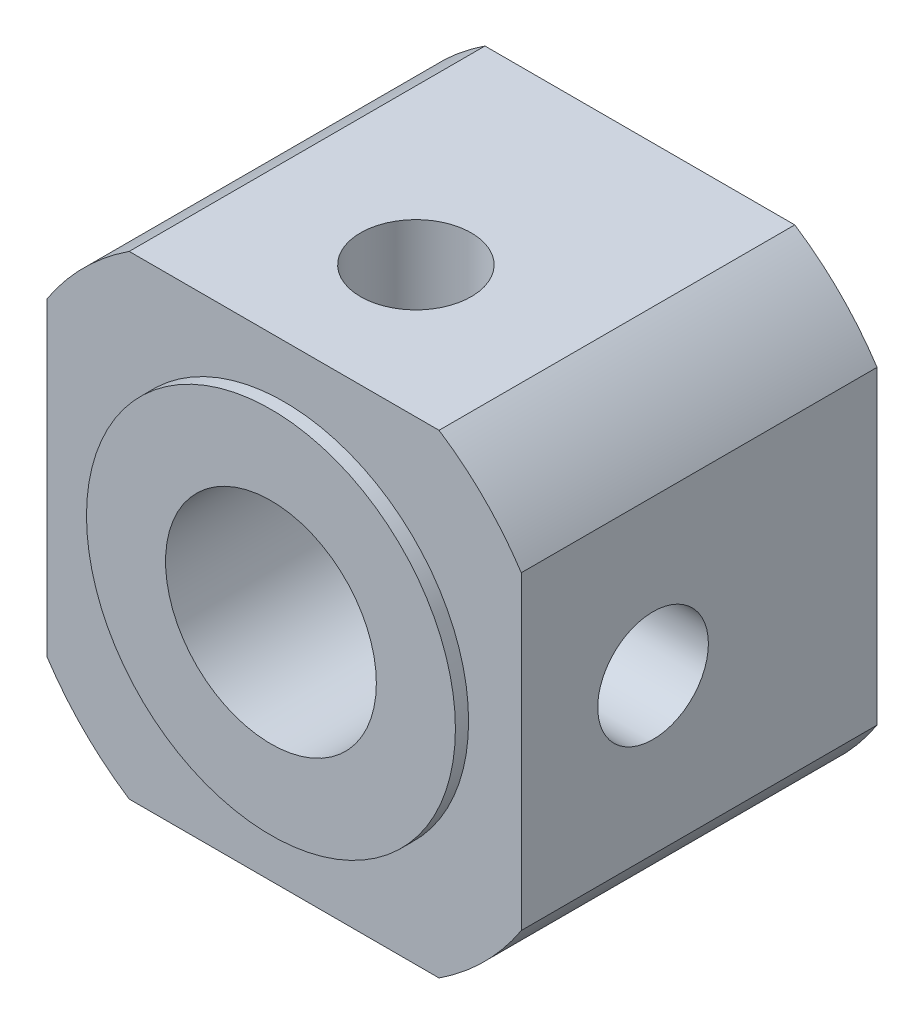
ISO-10303-21;
HEADER;
FILE_DESCRIPTION(('STEP AP214'),'2;1');
FILE_NAME('part.step','',(''),(''),'','','');
FILE_SCHEMA(('AUTOMOTIVE_DESIGN { 1 0 10303 214 1 1 1 1 }'));
ENDSEC;
DATA;
#1=APPLICATION_CONTEXT('core data for automotive mechanical design processes');
#2=APPLICATION_PROTOCOL_DEFINITION('international standard','automotive_design',2000,#1);
#3=PRODUCT_CONTEXT('',#1,'mechanical');
#4=PRODUCT('Part','Part','',(#3));
#5=PRODUCT_RELATED_PRODUCT_CATEGORY('part','',(#4));
#6=PRODUCT_DEFINITION_FORMATION('','',#4);
#7=PRODUCT_DEFINITION_CONTEXT('part definition',#1,'design');
#8=PRODUCT_DEFINITION('design','',#6,#7);
#9=PRODUCT_DEFINITION_SHAPE('','',#8);
#10=(LENGTH_UNIT() NAMED_UNIT(*) SI_UNIT(.MILLI.,.METRE.));
#11=(NAMED_UNIT(*) PLANE_ANGLE_UNIT() SI_UNIT($,.RADIAN.));
#12=(NAMED_UNIT(*) SI_UNIT($,.STERADIAN.) SOLID_ANGLE_UNIT());
#13=UNCERTAINTY_MEASURE_WITH_UNIT(LENGTH_MEASURE(1.E-05),#10,'distance_accuracy_value','');
#14=(GEOMETRIC_REPRESENTATION_CONTEXT(3) GLOBAL_UNCERTAINTY_ASSIGNED_CONTEXT((#13)) GLOBAL_UNIT_ASSIGNED_CONTEXT((#10,
#11,#12)) REPRESENTATION_CONTEXT('',''));
#15=CARTESIAN_POINT('',(0.,0.,0.));
#16=DIRECTION('',(0.,0.,1.));
#17=DIRECTION('',(1.,0.,0.));
#18=AXIS2_PLACEMENT_3D('',#15,#16,#17);
#19=CARTESIAN_POINT('',(0.,0.,5.));
#20=DIRECTION('',(0.,0.,1.));
#21=DIRECTION('',(1.,0.,0.));
#22=AXIS2_PLACEMENT_3D('',#19,#20,#21);
#23=CYLINDRICAL_SURFACE('',#22,7.);
#24=CARTESIAN_POINT('',(0.,0.,5.5));
#25=DIRECTION('',(0.,0.,1.));
#26=DIRECTION('',(1.,0.,0.));
#27=AXIS2_PLACEMENT_3D('',#24,#25,#26);
#28=CIRCLE('',#27,7.);
#29=CARTESIAN_POINT('',(7.,0.,5.5));
#30=VERTEX_POINT('',#29);
#31=EDGE_CURVE('E99',#30,#30,#28,.T.);
#32=ORIENTED_EDGE('',*,*,#31,.F.);
#33=EDGE_LOOP('',(#32));
#34=FACE_BOUND('',#33,.T.);
#35=CARTESIAN_POINT('',(0.,0.,5.));
#36=DIRECTION('',(0.,0.,1.));
#37=DIRECTION('',(1.,0.,0.));
#38=AXIS2_PLACEMENT_3D('',#35,#36,#37);
#39=CIRCLE('',#38,7.);
#40=CARTESIAN_POINT('',(7.,0.,5.));
#41=VERTEX_POINT('',#40);
#42=EDGE_CURVE('E20',#41,#41,#39,.F.);
#43=ORIENTED_EDGE('',*,*,#42,.F.);
#44=EDGE_LOOP('',(#43));
#45=FACE_BOUND('',#44,.T.);
#46=ADVANCED_FACE('F16',(#34,#45),#23,.T.);
#47=CARTESIAN_POINT('',(0.,0.,5.));
#48=DIRECTION('',(0.,0.,1.));
#49=DIRECTION('',(1.,0.,0.));
#50=AXIS2_PLACEMENT_3D('',#47,#48,#49);
#51=PLANE('',#50);
#52=ORIENTED_EDGE('',*,*,#42,.T.);
#53=EDGE_LOOP('',(#52));
#54=FACE_BOUND('',#53,.T.);
#55=CARTESIAN_POINT('',(0.,0.,5.));
#56=DIRECTION('',(0.,0.,1.));
#57=DIRECTION('',(1.,0.,0.));
#58=AXIS2_PLACEMENT_3D('',#55,#56,#57);
#59=CIRCLE('',#58,10.75);
#60=CARTESIAN_POINT('',(5.87898800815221,9.,5.));
#61=VERTEX_POINT('',#60);
#62=CARTESIAN_POINT('',(9.,5.87898800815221,5.));
#63=VERTEX_POINT('',#62);
#64=EDGE_CURVE('E89',#61,#63,#59,.F.);
#65=ORIENTED_EDGE('',*,*,#64,.F.);
#66=DIRECTION('',(1.,0.,0.));
#67=VECTOR('',#66,1.);
#68=CARTESIAN_POINT('',(5.878988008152,9.,5.));
#69=LINE('',#68,#67);
#70=CARTESIAN_POINT('',(-5.87898800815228,9.0000000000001,5.));
#71=VERTEX_POINT('',#70);
#72=EDGE_CURVE('E79',#71,#61,#69,.T.);
#73=ORIENTED_EDGE('',*,*,#72,.F.);
#74=CARTESIAN_POINT('',(0.,0.,5.));
#75=DIRECTION('',(0.,0.,1.));
#76=DIRECTION('',(1.,0.,0.));
#77=AXIS2_PLACEMENT_3D('',#74,#75,#76);
#78=CIRCLE('',#77,10.75);
#79=CARTESIAN_POINT('',(-9.,5.87898800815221,5.));
#80=VERTEX_POINT('',#79);
#81=EDGE_CURVE('E107',#80,#71,#78,.F.);
#82=ORIENTED_EDGE('',*,*,#81,.F.);
#83=DIRECTION('',(0.,1.,0.));
#84=VECTOR('',#83,1.);
#85=CARTESIAN_POINT('',(-9.,5.878988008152,5.));
#86=LINE('',#85,#84);
#87=CARTESIAN_POINT('',(-9.0000000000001,-5.87898800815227,5.));
#88=VERTEX_POINT('',#87);
#89=EDGE_CURVE('E118',#88,#80,#86,.T.);
#90=ORIENTED_EDGE('',*,*,#89,.F.);
#91=CARTESIAN_POINT('',(0.,0.,5.));
#92=DIRECTION('',(0.,0.,1.));
#93=DIRECTION('',(1.,0.,0.));
#94=AXIS2_PLACEMENT_3D('',#91,#92,#93);
#95=CIRCLE('',#94,10.75);
#96=CARTESIAN_POINT('',(-5.87898800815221,-9.,5.));
#97=VERTEX_POINT('',#96);
#98=EDGE_CURVE('E212',#97,#88,#95,.F.);
#99=ORIENTED_EDGE('',*,*,#98,.F.);
#100=DIRECTION('',(1.,0.,0.));
#101=VECTOR('',#100,1.);
#102=CARTESIAN_POINT('',(-5.878988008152,-9.,5.));
#103=LINE('',#102,#101);
#104=CARTESIAN_POINT('',(5.87898800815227,-9.0000000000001,5.));
#105=VERTEX_POINT('',#104);
#106=EDGE_CURVE('E114',#105,#97,#103,.F.);
#107=ORIENTED_EDGE('',*,*,#106,.F.);
#108=CARTESIAN_POINT('',(0.,0.,5.));
#109=DIRECTION('',(0.,0.,1.));
#110=DIRECTION('',(1.,0.,0.));
#111=AXIS2_PLACEMENT_3D('',#108,#109,#110);
#112=CIRCLE('',#111,10.75);
#113=CARTESIAN_POINT('',(9.,-5.87898800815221,5.));
#114=VERTEX_POINT('',#113);
#115=EDGE_CURVE('E210',#114,#105,#112,.F.);
#116=ORIENTED_EDGE('',*,*,#115,.F.);
#117=DIRECTION('',(0.,1.,0.));
#118=VECTOR('',#117,1.);
#119=CARTESIAN_POINT('',(9.,-5.878988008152,5.));
#120=LINE('',#119,#118);
#121=EDGE_CURVE('E95',#63,#114,#120,.F.);
#122=ORIENTED_EDGE('',*,*,#121,.F.);
#123=EDGE_LOOP('',(#65,#73,#82,#90,#99,#107,#116,#122));
#124=FACE_BOUND('',#123,.T.);
#125=ADVANCED_FACE('F93',(#54,#124),#51,.T.);
#126=CARTESIAN_POINT('',(0.,0.,5.5));
#127=DIRECTION('',(0.,0.,1.));
#128=DIRECTION('',(1.,0.,0.));
#129=AXIS2_PLACEMENT_3D('',#126,#127,#128);
#130=PLANE('',#129);
#131=CARTESIAN_POINT('',(0.,0.,5.5));
#132=DIRECTION('',(0.,0.,1.));
#133=DIRECTION('',(1.,0.,0.));
#134=AXIS2_PLACEMENT_3D('',#131,#132,#133);
#135=CIRCLE('',#134,4.);
#136=CARTESIAN_POINT('',(4.,0.,5.5));
#137=VERTEX_POINT('',#136);
#138=EDGE_CURVE('E250',#137,#137,#135,.F.);
#139=ORIENTED_EDGE('',*,*,#138,.T.);
#140=EDGE_LOOP('',(#139));
#141=FACE_BOUND('',#140,.T.);
#142=ORIENTED_EDGE('',*,*,#31,.T.);
#143=EDGE_LOOP('',(#142));
#144=FACE_BOUND('',#143,.T.);
#145=ADVANCED_FACE('F234',(#141,#144),#130,.T.);
#146=CARTESIAN_POINT('',(0.,0.,0.));
#147=DIRECTION('',(1.,0.,0.));
#148=DIRECTION('',(0.,0.,-1.));
#149=AXIS2_PLACEMENT_3D('',#146,#147,#148);
#150=CYLINDRICAL_SURFACE('',#149,2.1);
#151=CARTESIAN_POINT('',(9.,0.,0.));
#152=DIRECTION('',(1.,0.,0.));
#153=DIRECTION('',(0.,0.,-1.));
#154=AXIS2_PLACEMENT_3D('',#151,#152,#153);
#155=CIRCLE('',#154,2.1);
#156=CARTESIAN_POINT('',(9.,0.,-2.1));
#157=VERTEX_POINT('',#156);
#158=EDGE_CURVE('E207',#157,#157,#155,.F.);
#159=ORIENTED_EDGE('',*,*,#158,.F.);
#160=EDGE_LOOP('',(#159));
#161=FACE_BOUND('',#160,.T.);
#162=CARTESIAN_POINT('',(4.,0.,2.1));
#163=CARTESIAN_POINT('',(3.99999554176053,0.109803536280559,2.09999503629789));
#164=CARTESIAN_POINT('',(3.99543467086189,0.219658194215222,2.09134364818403));
#165=CARTESIAN_POINT('',(3.97764995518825,0.436025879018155,2.05715950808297));
#166=CARTESIAN_POINT('',(3.96441836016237,0.542535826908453,2.03161165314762));
#167=CARTESIAN_POINT('',(3.93066508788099,0.748842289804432,1.96492968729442));
#168=CARTESIAN_POINT('',(3.91017049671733,0.848662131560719,1.92385344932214));
#169=CARTESIAN_POINT('',(3.86373215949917,1.03983925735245,1.82762126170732));
#170=CARTESIAN_POINT('',(3.83778764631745,1.13119534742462,1.77246332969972));
#171=CARTESIAN_POINT('',(3.7808192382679,1.30947331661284,1.64560391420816));
#172=CARTESIAN_POINT('',(3.74957540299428,1.3957267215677,1.57306344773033));
#173=CARTESIAN_POINT('',(3.68617980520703,1.55546702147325,1.41532332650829));
#174=CARTESIAN_POINT('',(3.65402732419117,1.62894346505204,1.33011341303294));
#175=CARTESIAN_POINT('',(3.58917605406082,1.76753206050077,1.14052425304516));
#176=CARTESIAN_POINT('',(3.55667656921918,1.83134586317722,1.03511929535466));
#177=CARTESIAN_POINT('',(3.49855996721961,1.94007792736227,0.813221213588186));
#178=CARTESIAN_POINT('',(3.47293763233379,1.98501052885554,0.69673658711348));
#179=CARTESIAN_POINT('',(3.43398314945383,2.0516277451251,0.463269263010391));
#180=CARTESIAN_POINT('',(3.41998737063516,2.07458126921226,0.346765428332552));
#181=CARTESIAN_POINT('',(3.40418722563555,2.10042064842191,0.110792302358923));
#182=CARTESIAN_POINT('',(3.40236842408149,2.10333026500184,-0.0086733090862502));
#183=CARTESIAN_POINT('',(3.41060563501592,2.08992575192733,-0.229764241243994));
#184=CARTESIAN_POINT('',(3.41908941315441,2.0761574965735,-0.331617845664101));
#185=CARTESIAN_POINT('',(3.44418919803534,2.0342447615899,-0.531280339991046));
#186=CARTESIAN_POINT('',(3.46080826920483,2.00609486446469,-0.629087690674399));
#187=CARTESIAN_POINT('',(3.50064034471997,1.935761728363,-0.820661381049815));
#188=CARTESIAN_POINT('',(3.52399503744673,1.89327319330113,-0.914284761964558));
#189=CARTESIAN_POINT('',(3.57469224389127,1.79571567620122,-1.09354021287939));
#190=CARTESIAN_POINT('',(3.60203646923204,1.7406412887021,-1.17916882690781));
#191=CARTESIAN_POINT('',(3.66230185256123,1.61039980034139,-1.35277293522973));
#192=CARTESIAN_POINT('',(3.69546437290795,1.53349171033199,-1.43936319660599));
#193=CARTESIAN_POINT('',(3.76053411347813,1.36617837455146,-1.59904319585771));
#194=CARTESIAN_POINT('',(3.79244039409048,1.27576325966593,-1.67212297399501));
#195=CARTESIAN_POINT('',(3.85357924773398,1.07762049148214,-1.80661637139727));
#196=CARTESIAN_POINT('',(3.88255897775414,0.969203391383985,-1.86713779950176));
#197=CARTESIAN_POINT('',(3.93230876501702,0.741890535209,-1.96850527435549));
#198=CARTESIAN_POINT('',(3.95309407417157,0.623014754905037,-2.00938790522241));
#199=CARTESIAN_POINT('',(3.97880627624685,0.419385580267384,-2.05941202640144));
#200=CARTESIAN_POINT('',(3.98670889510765,0.336445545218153,-2.07458929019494));
#201=CARTESIAN_POINT('',(3.99730707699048,0.169013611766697,-2.09488442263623));
#202=CARTESIAN_POINT('',(4.00000343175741,0.0845219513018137,-2.10000382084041));
#203=CARTESIAN_POINT('',(3.99999554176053,-0.109803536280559,-2.09999503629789));
#204=CARTESIAN_POINT('',(3.99543467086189,-0.219658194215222,-2.09134364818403));
#205=CARTESIAN_POINT('',(3.97764995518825,-0.436025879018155,-2.05715950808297));
#206=CARTESIAN_POINT('',(3.96441836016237,-0.542535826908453,-2.03161165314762));
#207=CARTESIAN_POINT('',(3.93066508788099,-0.748842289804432,-1.96492968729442));
#208=CARTESIAN_POINT('',(3.91017049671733,-0.848662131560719,-1.92385344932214));
#209=CARTESIAN_POINT('',(3.86373215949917,-1.03983925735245,-1.82762126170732));
#210=CARTESIAN_POINT('',(3.83778764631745,-1.13119534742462,-1.77246332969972));
#211=CARTESIAN_POINT('',(3.7808192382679,-1.30947331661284,-1.64560391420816));
#212=CARTESIAN_POINT('',(3.74957540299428,-1.3957267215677,-1.57306344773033));
#213=CARTESIAN_POINT('',(3.68617980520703,-1.55546702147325,-1.41532332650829));
#214=CARTESIAN_POINT('',(3.65402732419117,-1.62894346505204,-1.33011341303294));
#215=CARTESIAN_POINT('',(3.58917605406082,-1.76753206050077,-1.14052425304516));
#216=CARTESIAN_POINT('',(3.55667656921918,-1.83134586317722,-1.03511929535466));
#217=CARTESIAN_POINT('',(3.49855996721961,-1.94007792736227,-0.813221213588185));
#218=CARTESIAN_POINT('',(3.47293763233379,-1.98501052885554,-0.696736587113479));
#219=CARTESIAN_POINT('',(3.43398314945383,-2.0516277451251,-0.463269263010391));
#220=CARTESIAN_POINT('',(3.41998737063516,-2.07458126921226,-0.346765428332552));
#221=CARTESIAN_POINT('',(3.40418722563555,-2.10042064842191,-0.110792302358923));
#222=CARTESIAN_POINT('',(3.40236842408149,-2.10333026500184,0.00867330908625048));
#223=CARTESIAN_POINT('',(3.41060563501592,-2.08992575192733,0.229764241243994));
#224=CARTESIAN_POINT('',(3.41908941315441,-2.0761574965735,0.331617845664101));
#225=CARTESIAN_POINT('',(3.44418919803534,-2.0342447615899,0.531280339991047));
#226=CARTESIAN_POINT('',(3.46080826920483,-2.00609486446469,0.6290876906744));
#227=CARTESIAN_POINT('',(3.50064034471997,-1.935761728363,0.820661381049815));
#228=CARTESIAN_POINT('',(3.52399503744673,-1.89327319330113,0.914284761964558));
#229=CARTESIAN_POINT('',(3.57469224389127,-1.79571567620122,1.09354021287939));
#230=CARTESIAN_POINT('',(3.60203646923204,-1.7406412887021,1.17916882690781));
#231=CARTESIAN_POINT('',(3.66230185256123,-1.61039980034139,1.35277293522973));
#232=CARTESIAN_POINT('',(3.69546437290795,-1.53349171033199,1.43936319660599));
#233=CARTESIAN_POINT('',(3.76053411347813,-1.36617837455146,1.59904319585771));
#234=CARTESIAN_POINT('',(3.79244039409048,-1.27576325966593,1.67212297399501));
#235=CARTESIAN_POINT('',(3.85357924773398,-1.07762049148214,1.80661637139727));
#236=CARTESIAN_POINT('',(3.88255897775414,-0.969203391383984,1.86713779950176));
#237=CARTESIAN_POINT('',(3.93230876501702,-0.741890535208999,1.96850527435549));
#238=CARTESIAN_POINT('',(3.95309407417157,-0.623014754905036,2.00938790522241));
#239=CARTESIAN_POINT('',(3.97880627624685,-0.419385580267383,2.05941202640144));
#240=CARTESIAN_POINT('',(3.98670889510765,-0.336445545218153,2.07458929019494));
#241=CARTESIAN_POINT('',(3.99730707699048,-0.169013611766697,2.09488442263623));
#242=CARTESIAN_POINT('',(4.00000343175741,-0.0845219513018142,2.10000382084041));
#243=CARTESIAN_POINT('',(4.,0.,2.1));
#244=B_SPLINE_CURVE_WITH_KNOTS('',3,(#162,#163,#164,#165,#166,#167,#168,#169,#170,#171,#172,
#173,#174,#175,#176,#177,#178,#179,#180,#181,#182,#183,#184,#185,#186,#187,#188,#189,#190,#191,
#192,#193,#194,#195,#196,#197,#198,#199,#200,#201,#202,#203,#204,#205,#206,#207,#208,#209,#210,
#211,#212,#213,#214,#215,#216,#217,#218,#219,#220,#221,#222,#223,#224,#225,#226,#227,#228,#229,
#230,#231,#232,#233,#234,#235,#236,#237,#238,#239,#240,#241,#242,#243),.UNSPECIFIED.,.T.,.F.,(4,
2,2,2,2,2,2,2,2,2,2,2,2,2,2,2,2,2,2,2,2,2,2,2,2,2,2,2,2,2,2,2,2,2,2,2,2,2,2,2,4),(0.,
0.329077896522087,0.658450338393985,0.986607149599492,1.31481018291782,1.66423090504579,
2.01393611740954,2.39430508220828,2.77438463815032,3.13089377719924,3.48698021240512,
3.79492359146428,4.1029830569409,4.41806553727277,4.7332835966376,5.09314587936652,
5.45327239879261,5.83374180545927,6.21349967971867,6.46684795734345,6.72015770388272,
7.0492356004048,7.3786080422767,7.70676485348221,8.03496788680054,8.3843886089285,
8.73409382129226,9.11446278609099,9.49454234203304,9.85105148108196,10.2071379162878,
10.515081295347,10.8231407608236,11.1382232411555,11.4534413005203,11.8133035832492,
12.1734301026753,12.553899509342,12.9336573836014,13.1870056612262,13.4403154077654),.UNSPECIFIED.);
#245=CARTESIAN_POINT('',(4.,0.,2.1));
#246=VERTEX_POINT('',#245);
#247=EDGE_CURVE('E140',#246,#246,#244,.T.);
#248=ORIENTED_EDGE('',*,*,#247,.T.);
#249=EDGE_LOOP('',(#248));
#250=FACE_BOUND('',#249,.T.);
#251=ADVANCED_FACE('F185',(#161,#250),#150,.F.);
#252=CARTESIAN_POINT('',(0.,0.,0.));
#253=DIRECTION('',(0.,1.,0.));
#254=DIRECTION('',(0.,0.,1.));
#255=AXIS2_PLACEMENT_3D('',#252,#253,#254);
#256=CYLINDRICAL_SURFACE('',#255,2.1);
#257=CARTESIAN_POINT('',(0.,9.,0.));
#258=DIRECTION('',(0.,1.,0.));
#259=DIRECTION('',(0.,0.,1.));
#260=AXIS2_PLACEMENT_3D('',#257,#258,#259);
#261=CIRCLE('',#260,2.1);
#262=CARTESIAN_POINT('',(0.,9.,2.1));
#263=VERTEX_POINT('',#262);
#264=EDGE_CURVE('E104',#263,#263,#261,.F.);
#265=ORIENTED_EDGE('',*,*,#264,.F.);
#266=EDGE_LOOP('',(#265));
#267=FACE_BOUND('',#266,.T.);
#268=CARTESIAN_POINT('',(0.,4.,-2.1));
#269=CARTESIAN_POINT('',(0.109803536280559,3.99999554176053,-2.09999503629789));
#270=CARTESIAN_POINT('',(0.219658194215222,3.99543467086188,-2.09134364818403));
#271=CARTESIAN_POINT('',(0.436025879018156,3.97764995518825,-2.05715950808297));
#272=CARTESIAN_POINT('',(0.542535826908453,3.96441836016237,-2.03161165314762));
#273=CARTESIAN_POINT('',(0.748842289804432,3.93066508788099,-1.96492968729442));
#274=CARTESIAN_POINT('',(0.84866213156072,3.91017049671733,-1.92385344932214));
#275=CARTESIAN_POINT('',(1.03983925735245,3.86373215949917,-1.82762126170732));
#276=CARTESIAN_POINT('',(1.13119534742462,3.83778764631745,-1.77246332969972));
#277=CARTESIAN_POINT('',(1.30947331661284,3.7808192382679,-1.64560391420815));
#278=CARTESIAN_POINT('',(1.3957267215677,3.74957540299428,-1.57306344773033));
#279=CARTESIAN_POINT('',(1.55546702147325,3.68617980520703,-1.41532332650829));
#280=CARTESIAN_POINT('',(1.62894346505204,3.65402732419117,-1.33011341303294));
#281=CARTESIAN_POINT('',(1.76753206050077,3.58917605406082,-1.14052425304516));
#282=CARTESIAN_POINT('',(1.83134586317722,3.55667656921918,-1.03511929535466));
#283=CARTESIAN_POINT('',(1.94007792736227,3.49855996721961,-0.813221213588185));
#284=CARTESIAN_POINT('',(1.98501052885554,3.47293763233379,-0.696736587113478));
#285=CARTESIAN_POINT('',(2.0516277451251,3.43398314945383,-0.46326926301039));
#286=CARTESIAN_POINT('',(2.07458126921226,3.41998737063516,-0.346765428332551));
#287=CARTESIAN_POINT('',(2.10042064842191,3.40418722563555,-0.110792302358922));
#288=CARTESIAN_POINT('',(2.10333026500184,3.40236842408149,0.00867330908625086));
#289=CARTESIAN_POINT('',(2.08992575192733,3.41060563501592,0.229764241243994));
#290=CARTESIAN_POINT('',(2.0761574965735,3.41908941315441,0.331617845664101));
#291=CARTESIAN_POINT('',(2.0342447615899,3.44418919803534,0.531280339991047));
#292=CARTESIAN_POINT('',(2.00609486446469,3.46080826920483,0.6290876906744));
#293=CARTESIAN_POINT('',(1.935761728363,3.50064034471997,0.820661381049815));
#294=CARTESIAN_POINT('',(1.89327319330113,3.52399503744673,0.914284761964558));
#295=CARTESIAN_POINT('',(1.79571567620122,3.57469224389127,1.09354021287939));
#296=CARTESIAN_POINT('',(1.7406412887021,3.60203646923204,1.17916882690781));
#297=CARTESIAN_POINT('',(1.61039980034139,3.66230185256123,1.35277293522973));
#298=CARTESIAN_POINT('',(1.53349171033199,3.69546437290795,1.43936319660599));
#299=CARTESIAN_POINT('',(1.36617837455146,3.76053411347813,1.59904319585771));
#300=CARTESIAN_POINT('',(1.27576325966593,3.79244039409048,1.67212297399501));
#301=CARTESIAN_POINT('',(1.07762049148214,3.85357924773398,1.80661637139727));
#302=CARTESIAN_POINT('',(0.969203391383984,3.88255897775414,1.86713779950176));
#303=CARTESIAN_POINT('',(0.741890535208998,3.93230876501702,1.96850527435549));
#304=CARTESIAN_POINT('',(0.623014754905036,3.95309407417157,2.00938790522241));
#305=CARTESIAN_POINT('',(0.419385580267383,3.97880627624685,2.05941202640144));
#306=CARTESIAN_POINT('',(0.336445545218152,3.98670889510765,2.07458929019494));
#307=CARTESIAN_POINT('',(0.169013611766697,3.99730707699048,2.09488442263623));
#308=CARTESIAN_POINT('',(0.0845219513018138,4.00000343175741,2.10000382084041));
#309=CARTESIAN_POINT('',(-0.109803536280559,3.99999554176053,2.09999503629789));
#310=CARTESIAN_POINT('',(-0.219658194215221,3.99543467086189,2.09134364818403));
#311=CARTESIAN_POINT('',(-0.436025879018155,3.97764995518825,2.05715950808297));
#312=CARTESIAN_POINT('',(-0.542535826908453,3.96441836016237,2.03161165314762));
#313=CARTESIAN_POINT('',(-0.748842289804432,3.93066508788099,1.96492968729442));
#314=CARTESIAN_POINT('',(-0.848662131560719,3.91017049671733,1.92385344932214));
#315=CARTESIAN_POINT('',(-1.03983925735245,3.86373215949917,1.82762126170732));
#316=CARTESIAN_POINT('',(-1.13119534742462,3.83778764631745,1.77246332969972));
#317=CARTESIAN_POINT('',(-1.30947331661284,3.7808192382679,1.64560391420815));
#318=CARTESIAN_POINT('',(-1.3957267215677,3.74957540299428,1.57306344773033));
#319=CARTESIAN_POINT('',(-1.55546702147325,3.68617980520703,1.41532332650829));
#320=CARTESIAN_POINT('',(-1.62894346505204,3.65402732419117,1.33011341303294));
#321=CARTESIAN_POINT('',(-1.76753206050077,3.58917605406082,1.14052425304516));
#322=CARTESIAN_POINT('',(-1.83134586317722,3.55667656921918,1.03511929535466));
#323=CARTESIAN_POINT('',(-1.94007792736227,3.49855996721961,0.813221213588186));
#324=CARTESIAN_POINT('',(-1.98501052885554,3.47293763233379,0.696736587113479));
#325=CARTESIAN_POINT('',(-2.0516277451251,3.43398314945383,0.46326926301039));
#326=CARTESIAN_POINT('',(-2.07458126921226,3.41998737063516,0.346765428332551));
#327=CARTESIAN_POINT('',(-2.10042064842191,3.40418722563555,0.110792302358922));
#328=CARTESIAN_POINT('',(-2.10333026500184,3.40236842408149,-0.00867330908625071));
#329=CARTESIAN_POINT('',(-2.08992575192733,3.41060563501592,-0.229764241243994));
#330=CARTESIAN_POINT('',(-2.0761574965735,3.41908941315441,-0.331617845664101));
#331=CARTESIAN_POINT('',(-2.0342447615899,3.44418919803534,-0.531280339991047));
#332=CARTESIAN_POINT('',(-2.00609486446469,3.46080826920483,-0.6290876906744));
#333=CARTESIAN_POINT('',(-1.935761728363,3.50064034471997,-0.820661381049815));
#334=CARTESIAN_POINT('',(-1.89327319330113,3.52399503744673,-0.914284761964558));
#335=CARTESIAN_POINT('',(-1.79571567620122,3.57469224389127,-1.09354021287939));
#336=CARTESIAN_POINT('',(-1.7406412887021,3.60203646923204,-1.17916882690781));
#337=CARTESIAN_POINT('',(-1.61039980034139,3.66230185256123,-1.35277293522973));
#338=CARTESIAN_POINT('',(-1.53349171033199,3.69546437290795,-1.43936319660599));
#339=CARTESIAN_POINT('',(-1.36617837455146,3.76053411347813,-1.59904319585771));
#340=CARTESIAN_POINT('',(-1.27576325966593,3.79244039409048,-1.67212297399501));
#341=CARTESIAN_POINT('',(-1.07762049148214,3.85357924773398,-1.80661637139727));
#342=CARTESIAN_POINT('',(-0.969203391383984,3.88255897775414,-1.86713779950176));
#343=CARTESIAN_POINT('',(-0.741890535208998,3.93230876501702,-1.96850527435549));
#344=CARTESIAN_POINT('',(-0.623014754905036,3.95309407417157,-2.00938790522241));
#345=CARTESIAN_POINT('',(-0.419385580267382,3.97880627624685,-2.05941202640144));
#346=CARTESIAN_POINT('',(-0.336445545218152,3.98670889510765,-2.07458929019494));
#347=CARTESIAN_POINT('',(-0.169013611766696,3.99730707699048,-2.09488442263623));
#348=CARTESIAN_POINT('',(-0.0845219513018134,4.00000343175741,-2.10000382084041));
#349=CARTESIAN_POINT('',(0.,4.,-2.1));
#350=B_SPLINE_CURVE_WITH_KNOTS('',3,(#268,#269,#270,#271,#272,#273,#274,#275,#276,#277,#278,
#279,#280,#281,#282,#283,#284,#285,#286,#287,#288,#289,#290,#291,#292,#293,#294,#295,#296,#297,
#298,#299,#300,#301,#302,#303,#304,#305,#306,#307,#308,#309,#310,#311,#312,#313,#314,#315,#316,
#317,#318,#319,#320,#321,#322,#323,#324,#325,#326,#327,#328,#329,#330,#331,#332,#333,#334,#335,
#336,#337,#338,#339,#340,#341,#342,#343,#344,#345,#346,#347,#348,#349),.UNSPECIFIED.,.T.,.F.,(4,
2,2,2,2,2,2,2,2,2,2,2,2,2,2,2,2,2,2,2,2,2,2,2,2,2,2,2,2,2,2,2,2,2,2,2,2,2,2,2,4),(0.,
0.329077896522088,0.658450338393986,0.986607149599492,1.31481018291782,1.66423090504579,
2.01393611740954,2.39430508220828,2.77438463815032,3.13089377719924,3.48698021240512,
3.79492359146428,4.1029830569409,4.41806553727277,4.7332835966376,5.09314587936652,
5.45327239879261,5.83374180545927,6.21349967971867,6.46684795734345,6.72015770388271,
7.0492356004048,7.3786080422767,7.70676485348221,8.03496788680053,8.3843886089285,
8.73409382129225,9.11446278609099,9.49454234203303,9.85105148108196,10.2071379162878,
10.515081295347,10.8231407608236,11.1382232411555,11.4534413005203,11.8133035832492,
12.1734301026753,12.553899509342,12.9336573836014,13.1870056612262,13.4403154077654),.UNSPECIFIED.);
#351=CARTESIAN_POINT('',(0.,4.,-2.1));
#352=VERTEX_POINT('',#351);
#353=EDGE_CURVE('E134',#352,#352,#350,.T.);
#354=ORIENTED_EDGE('',*,*,#353,.T.);
#355=EDGE_LOOP('',(#354));
#356=FACE_BOUND('',#355,.T.);
#357=ADVANCED_FACE('F145',(#267,#356),#256,.F.);
#358=CARTESIAN_POINT('',(0.,0.,-8.5));
#359=DIRECTION('',(0.,0.,1.));
#360=DIRECTION('',(1.,0.,0.));
#361=AXIS2_PLACEMENT_3D('',#358,#359,#360);
#362=CYLINDRICAL_SURFACE('',#361,10.75);
#363=ORIENTED_EDGE('',*,*,#64,.T.);
#364=DIRECTION('',(0.,0.,-1.));
#365=VECTOR('',#364,1.);
#366=CARTESIAN_POINT('',(9.,5.878988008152,-8.5));
#367=LINE('',#366,#365);
#368=CARTESIAN_POINT('',(9.,5.87898800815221,-8.5));
#369=VERTEX_POINT('',#368);
#370=EDGE_CURVE('E113',#369,#63,#367,.F.);
#371=ORIENTED_EDGE('',*,*,#370,.F.);
#372=CARTESIAN_POINT('',(0.,0.,-8.5));
#373=DIRECTION('',(0.,0.,1.));
#374=DIRECTION('',(1.,0.,0.));
#375=AXIS2_PLACEMENT_3D('',#372,#373,#374);
#376=CIRCLE('',#375,10.75);
#377=CARTESIAN_POINT('',(5.87898800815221,9.,-8.5));
#378=VERTEX_POINT('',#377);
#379=EDGE_CURVE('E103',#369,#378,#376,.T.);
#380=ORIENTED_EDGE('',*,*,#379,.T.);
#381=DIRECTION('',(0.,0.,1.));
#382=VECTOR('',#381,1.);
#383=CARTESIAN_POINT('',(5.878988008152,9.,-8.5));
#384=LINE('',#383,#382);
#385=EDGE_CURVE('E84',#61,#378,#384,.F.);
#386=ORIENTED_EDGE('',*,*,#385,.F.);
#387=EDGE_LOOP('',(#363,#371,#380,#386));
#388=FACE_BOUND('',#387,.T.);
#389=ADVANCED_FACE('F102',(#388),#362,.T.);
#390=CARTESIAN_POINT('',(5.878988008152,9.,-8.5));
#391=DIRECTION('',(0.,1.,0.));
#392=DIRECTION('',(0.,0.,1.));
#393=AXIS2_PLACEMENT_3D('',#390,#391,#392);
#394=PLANE('',#393);
#395=ORIENTED_EDGE('',*,*,#264,.T.);
#396=EDGE_LOOP('',(#395));
#397=FACE_BOUND('',#396,.T.);
#398=ORIENTED_EDGE('',*,*,#72,.T.);
#399=ORIENTED_EDGE('',*,*,#385,.T.);
#400=DIRECTION('',(1.,0.,0.));
#401=VECTOR('',#400,1.);
#402=CARTESIAN_POINT('',(0.,9.,-8.5));
#403=LINE('',#402,#401);
#404=CARTESIAN_POINT('',(-5.87898800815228,9.0000000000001,-8.5));
#405=VERTEX_POINT('',#404);
#406=EDGE_CURVE('E132',#378,#405,#403,.F.);
#407=ORIENTED_EDGE('',*,*,#406,.T.);
#408=DIRECTION('',(0.,0.,1.));
#409=VECTOR('',#408,1.);
#410=CARTESIAN_POINT('',(-5.87898800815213,9.00000000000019,-8.5));
#411=LINE('',#410,#409);
#412=EDGE_CURVE('E86',#71,#405,#411,.F.);
#413=ORIENTED_EDGE('',*,*,#412,.F.);
#414=EDGE_LOOP('',(#398,#399,#407,#413));
#415=FACE_BOUND('',#414,.T.);
#416=ADVANCED_FACE('F81',(#397,#415),#394,.T.);
#417=CARTESIAN_POINT('',(0.,0.,-8.5));
#418=DIRECTION('',(0.,0.,1.));
#419=DIRECTION('',(1.,0.,0.));
#420=AXIS2_PLACEMENT_3D('',#417,#418,#419);
#421=CYLINDRICAL_SURFACE('',#420,10.75);
#422=ORIENTED_EDGE('',*,*,#81,.T.);
#423=ORIENTED_EDGE('',*,*,#412,.T.);
#424=CARTESIAN_POINT('',(0.,0.,-8.5));
#425=DIRECTION('',(0.,0.,1.));
#426=DIRECTION('',(1.,0.,0.));
#427=AXIS2_PLACEMENT_3D('',#424,#425,#426);
#428=CIRCLE('',#427,10.75);
#429=CARTESIAN_POINT('',(-9.,5.87898800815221,-8.5));
#430=VERTEX_POINT('',#429);
#431=EDGE_CURVE('E129',#405,#430,#428,.T.);
#432=ORIENTED_EDGE('',*,*,#431,.T.);
#433=DIRECTION('',(0.,0.,1.));
#434=VECTOR('',#433,1.);
#435=CARTESIAN_POINT('',(-9.,5.878988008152,-8.5));
#436=LINE('',#435,#434);
#437=EDGE_CURVE('E119',#80,#430,#436,.F.);
#438=ORIENTED_EDGE('',*,*,#437,.F.);
#439=EDGE_LOOP('',(#422,#423,#432,#438));
#440=FACE_BOUND('',#439,.T.);
#441=ADVANCED_FACE('F173',(#440),#421,.T.);
#442=CARTESIAN_POINT('',(-9.,5.878988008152,-8.5));
#443=DIRECTION('',(-1.,0.,0.));
#444=DIRECTION('',(0.,0.,1.));
#445=AXIS2_PLACEMENT_3D('',#442,#443,#444);
#446=PLANE('',#445);
#447=ORIENTED_EDGE('',*,*,#89,.T.);
#448=ORIENTED_EDGE('',*,*,#437,.T.);
#449=DIRECTION('',(0.,1.,0.));
#450=VECTOR('',#449,1.);
#451=CARTESIAN_POINT('',(-9.,0.,-8.5));
#452=LINE('',#451,#450);
#453=CARTESIAN_POINT('',(-9.0000000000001,-5.87898800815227,-8.5));
#454=VERTEX_POINT('',#453);
#455=EDGE_CURVE('E128',#430,#454,#452,.F.);
#456=ORIENTED_EDGE('',*,*,#455,.T.);
#457=DIRECTION('',(0.,0.,1.));
#458=VECTOR('',#457,1.);
#459=CARTESIAN_POINT('',(-9.0000000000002,-5.87898800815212,-8.5));
#460=LINE('',#459,#458);
#461=EDGE_CURVE('E117',#88,#454,#460,.F.);
#462=ORIENTED_EDGE('',*,*,#461,.F.);
#463=EDGE_LOOP('',(#447,#448,#456,#462));
#464=FACE_BOUND('',#463,.T.);
#465=ADVANCED_FACE('F169',(#464),#446,.T.);
#466=CARTESIAN_POINT('',(0.,0.,-8.5));
#467=DIRECTION('',(0.,0.,1.));
#468=DIRECTION('',(1.,0.,0.));
#469=AXIS2_PLACEMENT_3D('',#466,#467,#468);
#470=CYLINDRICAL_SURFACE('',#469,10.75);
#471=ORIENTED_EDGE('',*,*,#98,.T.);
#472=ORIENTED_EDGE('',*,*,#461,.T.);
#473=CARTESIAN_POINT('',(0.,0.,-8.5));
#474=DIRECTION('',(0.,0.,1.));
#475=DIRECTION('',(1.,0.,0.));
#476=AXIS2_PLACEMENT_3D('',#473,#474,#475);
#477=CIRCLE('',#476,10.75);
#478=CARTESIAN_POINT('',(-5.87898800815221,-9.,-8.5));
#479=VERTEX_POINT('',#478);
#480=EDGE_CURVE('E125',#454,#479,#477,.T.);
#481=ORIENTED_EDGE('',*,*,#480,.T.);
#482=DIRECTION('',(0.,0.,-1.));
#483=VECTOR('',#482,1.);
#484=CARTESIAN_POINT('',(-5.878988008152,-9.,-8.5));
#485=LINE('',#484,#483);
#486=EDGE_CURVE('E116',#97,#479,#485,.T.);
#487=ORIENTED_EDGE('',*,*,#486,.F.);
#488=EDGE_LOOP('',(#471,#472,#481,#487));
#489=FACE_BOUND('',#488,.T.);
#490=ADVANCED_FACE('F165',(#489),#470,.T.);
#491=CARTESIAN_POINT('',(-5.878988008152,-9.,-8.5));
#492=DIRECTION('',(0.,-1.,0.));
#493=DIRECTION('',(0.,0.,-1.));
#494=AXIS2_PLACEMENT_3D('',#491,#492,#493);
#495=PLANE('',#494);
#496=ORIENTED_EDGE('',*,*,#106,.T.);
#497=ORIENTED_EDGE('',*,*,#486,.T.);
#498=DIRECTION('',(1.,0.,0.));
#499=VECTOR('',#498,1.);
#500=CARTESIAN_POINT('',(0.,-9.,-8.5));
#501=LINE('',#500,#499);
#502=CARTESIAN_POINT('',(5.87898800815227,-9.0000000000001,-8.5));
#503=VERTEX_POINT('',#502);
#504=EDGE_CURVE('E124',#479,#503,#501,.T.);
#505=ORIENTED_EDGE('',*,*,#504,.T.);
#506=DIRECTION('',(0.,0.,1.));
#507=VECTOR('',#506,1.);
#508=CARTESIAN_POINT('',(5.87898800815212,-9.0000000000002,-8.5));
#509=LINE('',#508,#507);
#510=EDGE_CURVE('E198',#105,#503,#509,.F.);
#511=ORIENTED_EDGE('',*,*,#510,.F.);
#512=EDGE_LOOP('',(#496,#497,#505,#511));
#513=FACE_BOUND('',#512,.T.);
#514=ADVANCED_FACE('F161',(#513),#495,.T.);
#515=CARTESIAN_POINT('',(0.,0.,-8.5));
#516=DIRECTION('',(0.,0.,1.));
#517=DIRECTION('',(1.,0.,0.));
#518=AXIS2_PLACEMENT_3D('',#515,#516,#517);
#519=CYLINDRICAL_SURFACE('',#518,10.75);
#520=ORIENTED_EDGE('',*,*,#115,.T.);
#521=ORIENTED_EDGE('',*,*,#510,.T.);
#522=CARTESIAN_POINT('',(0.,0.,-8.5));
#523=DIRECTION('',(0.,0.,1.));
#524=DIRECTION('',(1.,0.,0.));
#525=AXIS2_PLACEMENT_3D('',#522,#523,#524);
#526=CIRCLE('',#525,10.75);
#527=CARTESIAN_POINT('',(9.,-5.87898800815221,-8.5));
#528=VERTEX_POINT('',#527);
#529=EDGE_CURVE('E121',#503,#528,#526,.T.);
#530=ORIENTED_EDGE('',*,*,#529,.T.);
#531=DIRECTION('',(0.,0.,-1.));
#532=VECTOR('',#531,1.);
#533=CARTESIAN_POINT('',(9.,-5.878988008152,-8.5));
#534=LINE('',#533,#532);
#535=EDGE_CURVE('E35',#114,#528,#534,.T.);
#536=ORIENTED_EDGE('',*,*,#535,.F.);
#537=EDGE_LOOP('',(#520,#521,#530,#536));
#538=FACE_BOUND('',#537,.T.);
#539=ADVANCED_FACE('F157',(#538),#519,.T.);
#540=CARTESIAN_POINT('',(9.,-5.878988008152,-8.5));
#541=DIRECTION('',(1.,0.,0.));
#542=DIRECTION('',(0.,0.,-1.));
#543=AXIS2_PLACEMENT_3D('',#540,#541,#542);
#544=PLANE('',#543);
#545=ORIENTED_EDGE('',*,*,#158,.T.);
#546=EDGE_LOOP('',(#545));
#547=FACE_BOUND('',#546,.T.);
#548=ORIENTED_EDGE('',*,*,#121,.T.);
#549=ORIENTED_EDGE('',*,*,#535,.T.);
#550=DIRECTION('',(0.,1.,0.));
#551=VECTOR('',#550,1.);
#552=CARTESIAN_POINT('',(9.,0.,-8.5));
#553=LINE('',#552,#551);
#554=EDGE_CURVE('E26',#528,#369,#553,.T.);
#555=ORIENTED_EDGE('',*,*,#554,.T.);
#556=ORIENTED_EDGE('',*,*,#370,.T.);
#557=EDGE_LOOP('',(#548,#549,#555,#556));
#558=FACE_BOUND('',#557,.T.);
#559=ADVANCED_FACE('F152',(#547,#558),#544,.T.);
#560=CARTESIAN_POINT('',(0.,0.,-8.5));
#561=DIRECTION('',(0.,0.,1.));
#562=DIRECTION('',(1.,0.,0.));
#563=AXIS2_PLACEMENT_3D('',#560,#561,#562);
#564=CYLINDRICAL_SURFACE('',#563,4.);
#565=ORIENTED_EDGE('',*,*,#138,.F.);
#566=EDGE_LOOP('',(#565));
#567=FACE_BOUND('',#566,.T.);
#568=ORIENTED_EDGE('',*,*,#247,.F.);
#569=EDGE_LOOP('',(#568));
#570=FACE_BOUND('',#569,.T.);
#571=ORIENTED_EDGE('',*,*,#353,.F.);
#572=EDGE_LOOP('',(#571));
#573=FACE_BOUND('',#572,.T.);
#574=CARTESIAN_POINT('',(0.,0.,-8.5));
#575=DIRECTION('',(0.,0.,1.));
#576=DIRECTION('',(1.,0.,0.));
#577=AXIS2_PLACEMENT_3D('',#574,#575,#576);
#578=CIRCLE('',#577,4.);
#579=CARTESIAN_POINT('',(4.,0.,-8.5));
#580=VERTEX_POINT('',#579);
#581=EDGE_CURVE('E11',#580,#580,#578,.F.);
#582=ORIENTED_EDGE('',*,*,#581,.T.);
#583=EDGE_LOOP('',(#582));
#584=FACE_BOUND('',#583,.T.);
#585=ADVANCED_FACE('F148',(#567,#570,#573,#584),#564,.F.);
#586=CARTESIAN_POINT('',(0.,0.,-8.5));
#587=DIRECTION('',(0.,0.,1.));
#588=DIRECTION('',(1.,0.,0.));
#589=AXIS2_PLACEMENT_3D('',#586,#587,#588);
#590=PLANE('',#589);
#591=ORIENTED_EDGE('',*,*,#581,.F.);
#592=EDGE_LOOP('',(#591));
#593=FACE_BOUND('',#592,.T.);
#594=ORIENTED_EDGE('',*,*,#529,.F.);
#595=ORIENTED_EDGE('',*,*,#504,.F.);
#596=ORIENTED_EDGE('',*,*,#480,.F.);
#597=ORIENTED_EDGE('',*,*,#455,.F.);
#598=ORIENTED_EDGE('',*,*,#431,.F.);
#599=ORIENTED_EDGE('',*,*,#406,.F.);
#600=ORIENTED_EDGE('',*,*,#379,.F.);
#601=ORIENTED_EDGE('',*,*,#554,.F.);
#602=EDGE_LOOP('',(#594,#595,#596,#597,#598,#599,#600,#601));
#603=FACE_BOUND('',#602,.T.);
#604=ADVANCED_FACE('F18',(#593,#603),#590,.F.);
#605=CLOSED_SHELL('',(#46,#125,#145,#251,#357,#389,#416,#441,#465,#490,#514,#539,#559,#585,#604));
#606=MANIFOLD_SOLID_BREP('B1',#605);
#607=ADVANCED_BREP_SHAPE_REPRESENTATION('',(#18,#606),#14);
#608=SHAPE_DEFINITION_REPRESENTATION(#9,#607);
ENDSEC;
END-ISO-10303-21;
